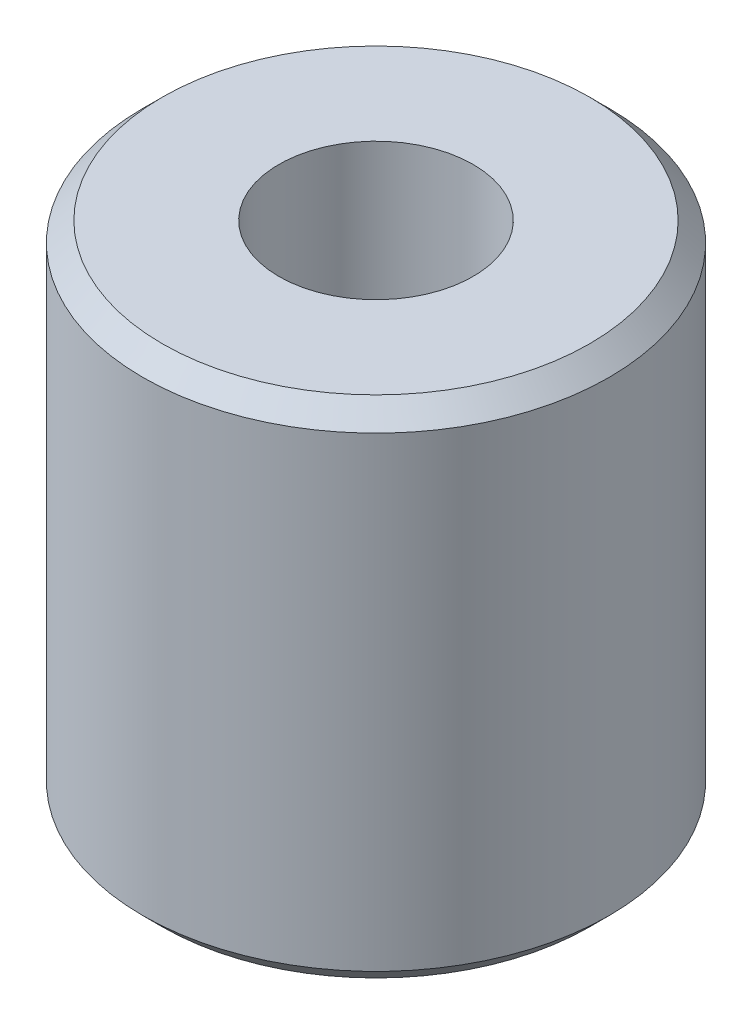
from build123d import *


with BuildPart() as part:
    # Esquisse1 → R_volution1 (revolve)
    with BuildSketch(Plane(origin=(0, 0, 0), x_dir=(-1, 0, 0), z_dir=(0, 0, -1)), mode=Mode.PRIVATE) as r_volution1_sk:
        Polygon((-5.5, -6.5), (-2.5, -6.5), (-2.5, 6.5), (-5.5, 6.5), (-6, 6), (-6, -6), align=None)
    revolve(r_volution1_sk.sketch.rotate(Axis((0, -6.5, 0), (0, 1, 0)), 270), axis=Axis((0, -6.5, 0), (0, 1, 0)))


solid = part.part
